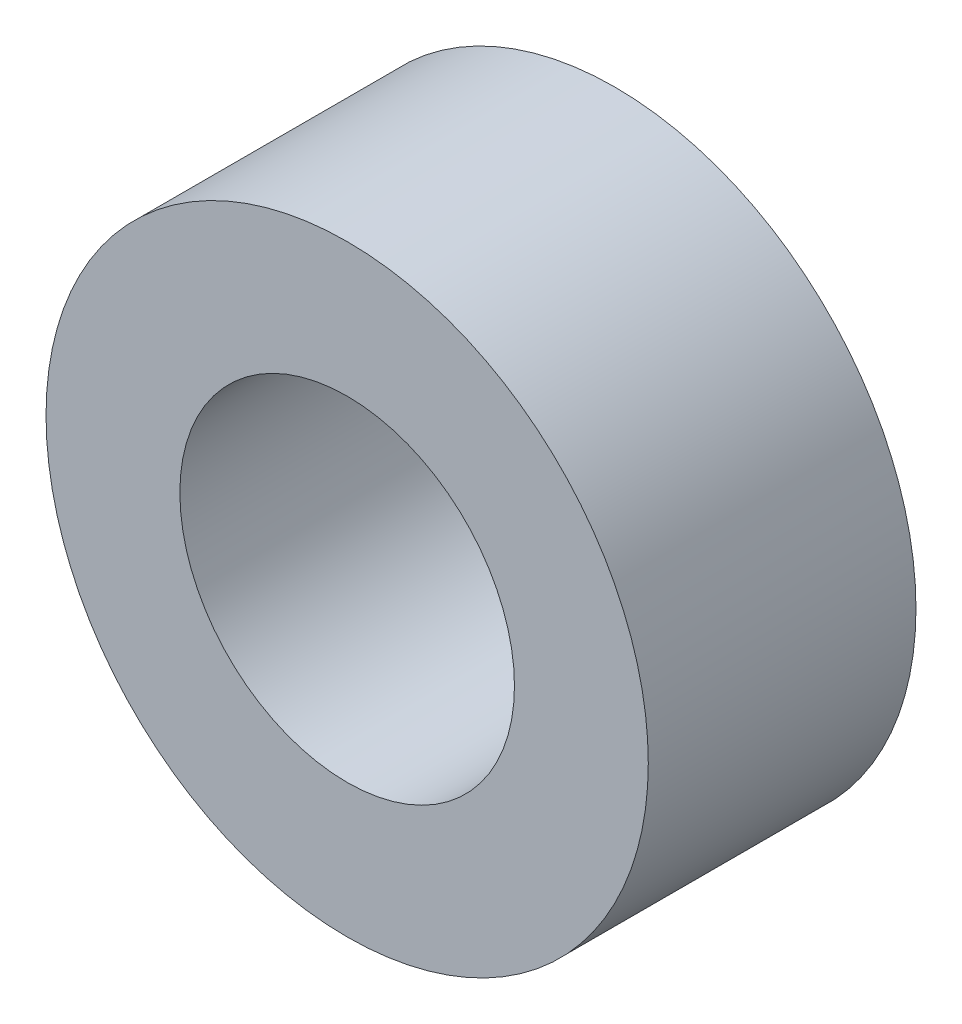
from build123d import *

# Parameters (mm, degrees)
ESBO_O1_R                = 4.5
ESBO_O1_R_2              = 2.5
RESSALTO_EXTRUS_O1_DEPTH = 4


with BuildPart() as part:
    # Esbo_o1 → Ressalto-extrus_o1 (new body)
    with BuildSketch(Plane.XY):
        Circle(ESBO_O1_R)
        Circle(ESBO_O1_R_2, mode=Mode.SUBTRACT)
    extrude(amount=RESSALTO_EXTRUS_O1_DEPTH)


solid = part.part
